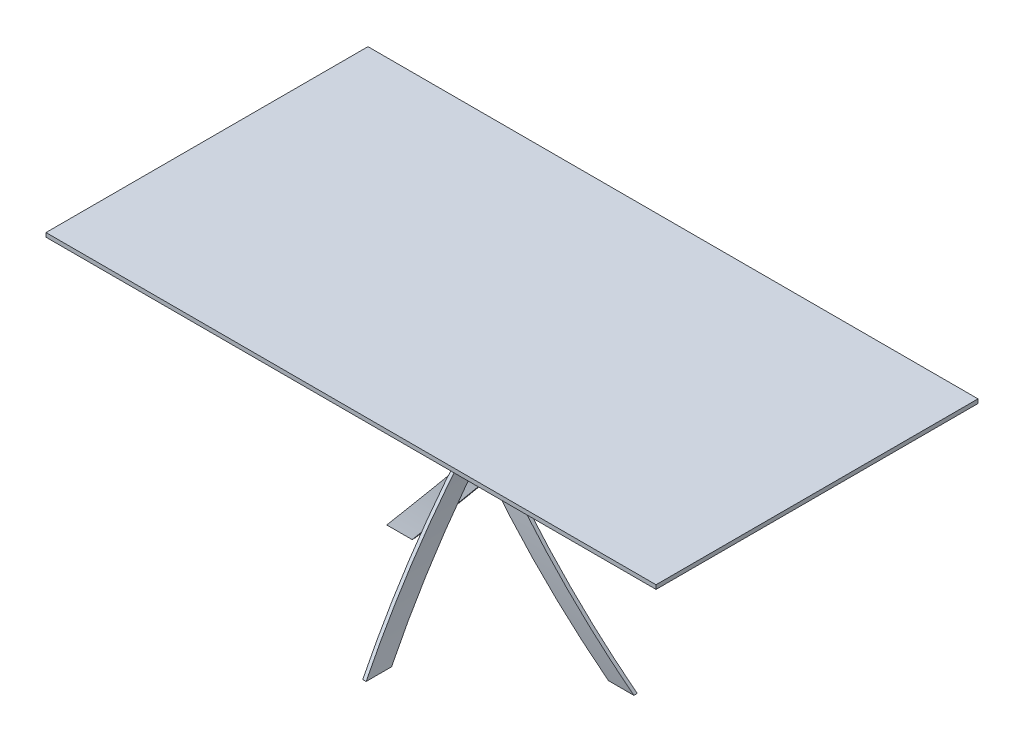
ISO-10303-21;
HEADER;
FILE_DESCRIPTION(('STEP AP214'),'2;1');
FILE_NAME('part.step','',(''),(''),'','','');
FILE_SCHEMA(('AUTOMOTIVE_DESIGN { 1 0 10303 214 1 1 1 1 }'));
ENDSEC;
DATA;
#1=APPLICATION_CONTEXT('core data for automotive mechanical design processes');
#2=APPLICATION_PROTOCOL_DEFINITION('international standard','automotive_design',2000,#1);
#3=PRODUCT_CONTEXT('',#1,'mechanical');
#4=PRODUCT('Part','Part','',(#3));
#5=PRODUCT_RELATED_PRODUCT_CATEGORY('part','',(#4));
#6=PRODUCT_DEFINITION_FORMATION('','',#4);
#7=PRODUCT_DEFINITION_CONTEXT('part definition',#1,'design');
#8=PRODUCT_DEFINITION('design','',#6,#7);
#9=PRODUCT_DEFINITION_SHAPE('','',#8);
#10=(LENGTH_UNIT() NAMED_UNIT(*) SI_UNIT(.MILLI.,.METRE.));
#11=(NAMED_UNIT(*) PLANE_ANGLE_UNIT() SI_UNIT($,.RADIAN.));
#12=(NAMED_UNIT(*) SI_UNIT($,.STERADIAN.) SOLID_ANGLE_UNIT());
#13=UNCERTAINTY_MEASURE_WITH_UNIT(LENGTH_MEASURE(1.E-05),#10,'distance_accuracy_value','');
#14=(GEOMETRIC_REPRESENTATION_CONTEXT(3) GLOBAL_UNCERTAINTY_ASSIGNED_CONTEXT((#13)) GLOBAL_UNIT_ASSIGNED_CONTEXT((#10,
#11,#12)) REPRESENTATION_CONTEXT('',''));
#15=CARTESIAN_POINT('',(0.,0.,0.));
#16=DIRECTION('',(0.,0.,1.));
#17=DIRECTION('',(1.,0.,0.));
#18=AXIS2_PLACEMENT_3D('',#15,#16,#17);
#19=CARTESIAN_POINT('',(1721.56180703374,370.,500.000000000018));
#20=DIRECTION('',(0.,0.,-1.));
#21=DIRECTION('',(-1.,0.,0.));
#22=AXIS2_PLACEMENT_3D('',#19,#20,#21);
#23=CYLINDRICAL_SURFACE('',#22,1800.);
#24=DIRECTION('',(0.,0.,-1.));
#25=VECTOR('',#24,1.);
#26=CARTESIAN_POINT('',(-40.4188966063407,1.99999999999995,499.999999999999));
#27=LINE('',#26,#25);
#28=CARTESIAN_POINT('',(-40.4188966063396,1.99999999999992,399.994999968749));
#29=VERTEX_POINT('',#28);
#30=CARTESIAN_POINT('',(-40.418896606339,1.99999999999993,324.994999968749));
#31=VERTEX_POINT('',#30);
#32=EDGE_CURVE('E70',#29,#31,#27,.T.);
#33=ORIENTED_EDGE('',*,*,#32,.F.);
#34=CARTESIAN_POINT('',(1721.56180703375,370.,100.808008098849));
#35=DIRECTION('',(0.,0.63083008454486,0.775921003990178));
#36=DIRECTION('',(0.,0.775921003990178,-0.63083008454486));
#37=AXIS2_PLACEMENT_3D('',#34,#35,#36);
#38=ELLIPSE('',#37,2319.82378456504,1800.);
#39=CARTESIAN_POINT('',(-39.9999999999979,740.,-200.005000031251));
#40=VERTEX_POINT('',#39);
#41=EDGE_CURVE('E90',#40,#29,#38,.T.);
#42=ORIENTED_EDGE('',*,*,#41,.F.);
#43=CARTESIAN_POINT('',(1721.56180703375,370.,-200.005000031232));
#44=DIRECTION('',(0.,0.,-1.));
#45=DIRECTION('',(-1.,0.,0.));
#46=AXIS2_PLACEMENT_3D('',#43,#44,#45);
#47=CIRCLE('',#46,1800.);
#48=CARTESIAN_POINT('',(-56.8799090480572,647.75,-200.005000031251));
#49=VERTEX_POINT('',#48);
#50=EDGE_CURVE('E87',#49,#40,#47,.T.);
#51=ORIENTED_EDGE('',*,*,#50,.F.);
#52=CARTESIAN_POINT('',(1721.56180703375,370.,25.808008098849));
#53=DIRECTION('',(0.,-0.63083008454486,-0.775921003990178));
#54=DIRECTION('',(0.,0.775921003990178,-0.63083008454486));
#55=AXIS2_PLACEMENT_3D('',#52,#53,#54);
#56=ELLIPSE('',#55,2319.82378456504,1800.);
#57=EDGE_CURVE('E50',#31,#49,#56,.T.);
#58=ORIENTED_EDGE('',*,*,#57,.F.);
#59=EDGE_LOOP('',(#33,#42,#51,#58));
#60=FACE_BOUND('',#59,.T.);
#61=ADVANCED_FACE('F46',(#60),#23,.T.);
#62=CARTESIAN_POINT('',(-300.000000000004,1.99999999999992,399.994999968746));
#63=DIRECTION('',(0.,0.63083008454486,0.775921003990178));
#64=DIRECTION('',(0.,-0.775921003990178,0.63083008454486));
#65=AXIS2_PLACEMENT_3D('',#62,#63,#64);
#66=PLANE('',#65);
#67=DIRECTION('',(1.,0.,0.));
#68=VECTOR('',#67,1.);
#69=CARTESIAN_POINT('',(-299.999999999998,740.,-200.005000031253));
#70=LINE('',#69,#68);
#71=CARTESIAN_POINT('',(-29.9999999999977,740.,-200.005000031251));
#72=VERTEX_POINT('',#71);
#73=EDGE_CURVE('E110',#40,#72,#70,.T.);
#74=ORIENTED_EDGE('',*,*,#73,.F.);
#75=ORIENTED_EDGE('',*,*,#41,.T.);
#76=DIRECTION('',(1.,0.,0.));
#77=VECTOR('',#76,1.);
#78=CARTESIAN_POINT('',(-300.000000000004,1.99999999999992,399.994999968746));
#79=LINE('',#78,#77);
#80=CARTESIAN_POINT('',(-30.4188966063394,1.99999999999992,399.994999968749));
#81=VERTEX_POINT('',#80);
#82=EDGE_CURVE('E104',#29,#81,#79,.T.);
#83=ORIENTED_EDGE('',*,*,#82,.T.);
#84=CARTESIAN_POINT('',(1731.56180703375,370.,100.808008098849));
#85=DIRECTION('',(0.,0.63083008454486,0.775921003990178));
#86=DIRECTION('',(0.,0.775921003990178,-0.63083008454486));
#87=AXIS2_PLACEMENT_3D('',#84,#85,#86);
#88=ELLIPSE('',#87,2319.82378456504,1800.);
#89=EDGE_CURVE('E95',#81,#72,#88,.F.);
#90=ORIENTED_EDGE('',*,*,#89,.T.);
#91=EDGE_LOOP('',(#74,#75,#83,#90));
#92=FACE_BOUND('',#91,.T.);
#93=ADVANCED_FACE('F119',(#92),#66,.T.);
#94=CARTESIAN_POINT('',(-299.999999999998,647.75,-200.005000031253));
#95=DIRECTION('',(0.,-0.63083008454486,-0.775921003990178));
#96=DIRECTION('',(0.,0.775921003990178,-0.63083008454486));
#97=AXIS2_PLACEMENT_3D('',#94,#95,#96);
#98=PLANE('',#97);
#99=DIRECTION('',(1.,0.,0.));
#100=VECTOR('',#99,1.);
#101=CARTESIAN_POINT('',(-300.000000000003,1.99999999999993,324.994999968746));
#102=LINE('',#101,#100);
#103=CARTESIAN_POINT('',(-30.4188966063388,1.99999999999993,324.994999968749));
#104=VERTEX_POINT('',#103);
#105=EDGE_CURVE('E12',#31,#104,#102,.T.);
#106=ORIENTED_EDGE('',*,*,#105,.F.);
#107=ORIENTED_EDGE('',*,*,#57,.T.);
#108=DIRECTION('',(1.,0.,0.));
#109=VECTOR('',#108,1.);
#110=CARTESIAN_POINT('',(-299.999999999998,647.75,-200.005000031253));
#111=LINE('',#110,#109);
#112=CARTESIAN_POINT('',(-46.879909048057,647.75,-200.005000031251));
#113=VERTEX_POINT('',#112);
#114=EDGE_CURVE('E55',#49,#113,#111,.T.);
#115=ORIENTED_EDGE('',*,*,#114,.T.);
#116=CARTESIAN_POINT('',(1731.56180703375,370.,25.8080080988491));
#117=DIRECTION('',(0.,-0.63083008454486,-0.775921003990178));
#118=DIRECTION('',(0.,0.775921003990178,-0.63083008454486));
#119=AXIS2_PLACEMENT_3D('',#116,#117,#118);
#120=ELLIPSE('',#119,2319.82378456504,1800.);
#121=EDGE_CURVE('E100',#113,#104,#120,.F.);
#122=ORIENTED_EDGE('',*,*,#121,.T.);
#123=EDGE_LOOP('',(#106,#107,#115,#122));
#124=FACE_BOUND('',#123,.T.);
#125=ADVANCED_FACE('F48',(#124),#98,.T.);
#126=CARTESIAN_POINT('',(-300.000000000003,1.99999999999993,324.994999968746));
#127=DIRECTION('',(0.,-1.,0.));
#128=DIRECTION('',(0.,0.,-1.));
#129=AXIS2_PLACEMENT_3D('',#126,#127,#128);
#130=PLANE('',#129);
#131=ORIENTED_EDGE('',*,*,#82,.F.);
#132=ORIENTED_EDGE('',*,*,#32,.T.);
#133=ORIENTED_EDGE('',*,*,#105,.T.);
#134=DIRECTION('',(0.,0.,-1.));
#135=VECTOR('',#134,1.);
#136=CARTESIAN_POINT('',(-30.4188966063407,1.99999999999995,500.));
#137=LINE('',#136,#135);
#138=EDGE_CURVE('E62',#104,#81,#137,.F.);
#139=ORIENTED_EDGE('',*,*,#138,.T.);
#140=EDGE_LOOP('',(#131,#132,#133,#139));
#141=FACE_BOUND('',#140,.T.);
#142=ADVANCED_FACE('F118',(#141),#130,.T.);
#143=CARTESIAN_POINT('',(-299.999999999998,740.,-200.005000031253));
#144=DIRECTION('',(0.,0.,-1.));
#145=DIRECTION('',(-1.,0.,0.));
#146=AXIS2_PLACEMENT_3D('',#143,#144,#145);
#147=PLANE('',#146);
#148=ORIENTED_EDGE('',*,*,#114,.F.);
#149=ORIENTED_EDGE('',*,*,#50,.T.);
#150=ORIENTED_EDGE('',*,*,#73,.T.);
#151=CARTESIAN_POINT('',(1731.56180703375,370.,-200.005000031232));
#152=DIRECTION('',(0.,0.,-1.));
#153=DIRECTION('',(-1.,0.,0.));
#154=AXIS2_PLACEMENT_3D('',#151,#152,#153);
#155=CIRCLE('',#154,1800.);
#156=EDGE_CURVE('E96',#72,#113,#155,.F.);
#157=ORIENTED_EDGE('',*,*,#156,.T.);
#158=EDGE_LOOP('',(#148,#149,#150,#157));
#159=FACE_BOUND('',#158,.T.);
#160=ADVANCED_FACE('F101',(#159),#147,.T.);
#161=CARTESIAN_POINT('',(1731.56180703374,370.,500.000000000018));
#162=DIRECTION('',(0.,0.,-1.));
#163=DIRECTION('',(-1.,0.,0.));
#164=AXIS2_PLACEMENT_3D('',#161,#162,#163);
#165=CYLINDRICAL_SURFACE('',#164,1800.);
#166=ORIENTED_EDGE('',*,*,#138,.F.);
#167=ORIENTED_EDGE('',*,*,#121,.F.);
#168=ORIENTED_EDGE('',*,*,#156,.F.);
#169=ORIENTED_EDGE('',*,*,#89,.F.);
#170=EDGE_LOOP('',(#166,#167,#168,#169));
#171=FACE_BOUND('',#170,.T.);
#172=ADVANCED_FACE('F122',(#171),#165,.F.);
#173=CLOSED_SHELL('',(#61,#93,#125,#142,#160,#172));
#174=MANIFOLD_SOLID_BREP('B2',#173);
#175=CARTESIAN_POINT('',(500.,370.,-1721.56180703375));
#176=DIRECTION('',(-1.,0.,0.));
#177=DIRECTION('',(0.,0.,1.));
#178=AXIS2_PLACEMENT_3D('',#175,#176,#177);
#179=CYLINDRICAL_SURFACE('',#178,1800.);
#180=DIRECTION('',(-1.,0.,0.));
#181=VECTOR('',#180,1.);
#182=CARTESIAN_POINT('',(500.,1.99999999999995,40.4188966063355));
#183=LINE('',#182,#181);
#184=CARTESIAN_POINT('',(399.99499996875,1.99999999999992,40.4188966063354));
#185=VERTEX_POINT('',#184);
#186=CARTESIAN_POINT('',(324.99499996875,1.99999999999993,40.4188966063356));
#187=VERTEX_POINT('',#186);
#188=EDGE_CURVE('E216',#185,#187,#183,.T.);
#189=ORIENTED_EDGE('',*,*,#188,.F.);
#190=CARTESIAN_POINT('',(100.808008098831,370.,-1721.56180703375));
#191=DIRECTION('',(0.775921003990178,0.63083008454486,0.));
#192=DIRECTION('',(-0.63083008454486,0.775921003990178,0.));
#193=AXIS2_PLACEMENT_3D('',#190,#191,#192);
#194=ELLIPSE('',#193,2319.82378456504,1800.);
#195=CARTESIAN_POINT('',(-200.00500003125,740.,40.));
#196=VERTEX_POINT('',#195);
#197=EDGE_CURVE('E236',#196,#185,#194,.T.);
#198=ORIENTED_EDGE('',*,*,#197,.F.);
#199=CARTESIAN_POINT('',(-200.00500003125,370.,-1721.56180703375));
#200=DIRECTION('',(-1.,0.,0.));
#201=DIRECTION('',(0.,0.,1.));
#202=AXIS2_PLACEMENT_3D('',#199,#200,#201);
#203=CIRCLE('',#202,1800.);
#204=CARTESIAN_POINT('',(-200.00500003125,647.75,56.8799090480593));
#205=VERTEX_POINT('',#204);
#206=EDGE_CURVE('E233',#205,#196,#203,.T.);
#207=ORIENTED_EDGE('',*,*,#206,.F.);
#208=CARTESIAN_POINT('',(25.808008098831,370.,-1721.56180703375));
#209=DIRECTION('',(-0.775921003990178,-0.63083008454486,0.));
#210=DIRECTION('',(-0.63083008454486,0.775921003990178,0.));
#211=AXIS2_PLACEMENT_3D('',#208,#209,#210);
#212=ELLIPSE('',#211,2319.82378456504,1800.);
#213=EDGE_CURVE('E196',#187,#205,#212,.T.);
#214=ORIENTED_EDGE('',*,*,#213,.F.);
#215=EDGE_LOOP('',(#189,#198,#207,#214));
#216=FACE_BOUND('',#215,.T.);
#217=ADVANCED_FACE('F192',(#216),#179,.T.);
#218=CARTESIAN_POINT('',(399.99499996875,1.99999999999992,300.));
#219=DIRECTION('',(0.775921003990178,0.63083008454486,0.));
#220=DIRECTION('',(0.63083008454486,-0.775921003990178,0.));
#221=AXIS2_PLACEMENT_3D('',#218,#219,#220);
#222=PLANE('',#221);
#223=DIRECTION('',(0.,0.,-1.));
#224=VECTOR('',#223,1.);
#225=CARTESIAN_POINT('',(-200.00500003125,740.,300.));
#226=LINE('',#225,#224);
#227=CARTESIAN_POINT('',(-200.00500003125,740.,29.9999999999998));
#228=VERTEX_POINT('',#227);
#229=EDGE_CURVE('E256',#196,#228,#226,.T.);
#230=ORIENTED_EDGE('',*,*,#229,.F.);
#231=ORIENTED_EDGE('',*,*,#197,.T.);
#232=DIRECTION('',(0.,0.,-1.));
#233=VECTOR('',#232,1.);
#234=CARTESIAN_POINT('',(399.99499996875,1.99999999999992,300.));
#235=LINE('',#234,#233);
#236=CARTESIAN_POINT('',(399.99499996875,1.99999999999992,30.4188966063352));
#237=VERTEX_POINT('',#236);
#238=EDGE_CURVE('E250',#185,#237,#235,.T.);
#239=ORIENTED_EDGE('',*,*,#238,.T.);
#240=CARTESIAN_POINT('',(100.808008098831,370.,-1731.56180703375));
#241=DIRECTION('',(0.775921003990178,0.63083008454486,0.));
#242=DIRECTION('',(-0.63083008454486,0.775921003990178,0.));
#243=AXIS2_PLACEMENT_3D('',#240,#241,#242);
#244=ELLIPSE('',#243,2319.82378456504,1800.);
#245=EDGE_CURVE('E241',#237,#228,#244,.F.);
#246=ORIENTED_EDGE('',*,*,#245,.T.);
#247=EDGE_LOOP('',(#230,#231,#239,#246));
#248=FACE_BOUND('',#247,.T.);
#249=ADVANCED_FACE('F265',(#248),#222,.T.);
#250=CARTESIAN_POINT('',(-200.00500003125,647.75,300.));
#251=DIRECTION('',(-0.775921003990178,-0.63083008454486,0.));
#252=DIRECTION('',(-0.63083008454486,0.775921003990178,0.));
#253=AXIS2_PLACEMENT_3D('',#250,#251,#252);
#254=PLANE('',#253);
#255=DIRECTION('',(0.,0.,-1.));
#256=VECTOR('',#255,1.);
#257=CARTESIAN_POINT('',(324.99499996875,1.99999999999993,300.));
#258=LINE('',#257,#256);
#259=CARTESIAN_POINT('',(324.99499996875,1.99999999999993,30.4188966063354));
#260=VERTEX_POINT('',#259);
#261=EDGE_CURVE('E44',#187,#260,#258,.T.);
#262=ORIENTED_EDGE('',*,*,#261,.F.);
#263=ORIENTED_EDGE('',*,*,#213,.T.);
#264=DIRECTION('',(0.,0.,-1.));
#265=VECTOR('',#264,1.);
#266=CARTESIAN_POINT('',(-200.00500003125,647.75,300.));
#267=LINE('',#266,#265);
#268=CARTESIAN_POINT('',(-200.00500003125,647.75,46.8799090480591));
#269=VERTEX_POINT('',#268);
#270=EDGE_CURVE('E201',#205,#269,#267,.T.);
#271=ORIENTED_EDGE('',*,*,#270,.T.);
#272=CARTESIAN_POINT('',(25.808008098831,370.,-1731.56180703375));
#273=DIRECTION('',(-0.775921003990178,-0.63083008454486,0.));
#274=DIRECTION('',(-0.63083008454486,0.775921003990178,0.));
#275=AXIS2_PLACEMENT_3D('',#272,#273,#274);
#276=ELLIPSE('',#275,2319.82378456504,1800.);
#277=EDGE_CURVE('E246',#269,#260,#276,.F.);
#278=ORIENTED_EDGE('',*,*,#277,.T.);
#279=EDGE_LOOP('',(#262,#263,#271,#278));
#280=FACE_BOUND('',#279,.T.);
#281=ADVANCED_FACE('F194',(#280),#254,.T.);
#282=CARTESIAN_POINT('',(324.99499996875,1.99999999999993,300.));
#283=DIRECTION('',(0.,-1.,0.));
#284=DIRECTION('',(-1.,0.,0.));
#285=AXIS2_PLACEMENT_3D('',#282,#283,#284);
#286=PLANE('',#285);
#287=ORIENTED_EDGE('',*,*,#238,.F.);
#288=ORIENTED_EDGE('',*,*,#188,.T.);
#289=ORIENTED_EDGE('',*,*,#261,.T.);
#290=DIRECTION('',(-1.,0.,0.));
#291=VECTOR('',#290,1.);
#292=CARTESIAN_POINT('',(500.,1.99999999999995,30.4188966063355));
#293=LINE('',#292,#291);
#294=EDGE_CURVE('E208',#260,#237,#293,.F.);
#295=ORIENTED_EDGE('',*,*,#294,.T.);
#296=EDGE_LOOP('',(#287,#288,#289,#295));
#297=FACE_BOUND('',#296,.T.);
#298=ADVANCED_FACE('F264',(#297),#286,.T.);
#299=CARTESIAN_POINT('',(-200.00500003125,740.,300.));
#300=DIRECTION('',(-1.,0.,0.));
#301=DIRECTION('',(0.,0.,1.));
#302=AXIS2_PLACEMENT_3D('',#299,#300,#301);
#303=PLANE('',#302);
#304=ORIENTED_EDGE('',*,*,#270,.F.);
#305=ORIENTED_EDGE('',*,*,#206,.T.);
#306=ORIENTED_EDGE('',*,*,#229,.T.);
#307=CARTESIAN_POINT('',(-200.00500003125,370.,-1731.56180703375));
#308=DIRECTION('',(-1.,0.,0.));
#309=DIRECTION('',(0.,0.,1.));
#310=AXIS2_PLACEMENT_3D('',#307,#308,#309);
#311=CIRCLE('',#310,1800.);
#312=EDGE_CURVE('E242',#228,#269,#311,.F.);
#313=ORIENTED_EDGE('',*,*,#312,.T.);
#314=EDGE_LOOP('',(#304,#305,#306,#313));
#315=FACE_BOUND('',#314,.T.);
#316=ADVANCED_FACE('F247',(#315),#303,.T.);
#317=CARTESIAN_POINT('',(500.,370.,-1731.56180703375));
#318=DIRECTION('',(-1.,0.,0.));
#319=DIRECTION('',(0.,0.,1.));
#320=AXIS2_PLACEMENT_3D('',#317,#318,#319);
#321=CYLINDRICAL_SURFACE('',#320,1800.);
#322=ORIENTED_EDGE('',*,*,#294,.F.);
#323=ORIENTED_EDGE('',*,*,#277,.F.);
#324=ORIENTED_EDGE('',*,*,#312,.F.);
#325=ORIENTED_EDGE('',*,*,#245,.F.);
#326=EDGE_LOOP('',(#322,#323,#324,#325));
#327=FACE_BOUND('',#326,.T.);
#328=ADVANCED_FACE('F268',(#327),#321,.F.);
#329=CLOSED_SHELL('',(#217,#249,#281,#298,#316,#328));
#330=MANIFOLD_SOLID_BREP('B6',#329);
#331=CARTESIAN_POINT('',(-1721.56180703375,370.,-500.000000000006));
#332=DIRECTION('',(0.,0.,1.));
#333=DIRECTION('',(1.,0.,0.));
#334=AXIS2_PLACEMENT_3D('',#331,#332,#333);
#335=CYLINDRICAL_SURFACE('',#334,1800.);
#336=DIRECTION('',(0.,0.,1.));
#337=VECTOR('',#336,1.);
#338=CARTESIAN_POINT('',(40.4188966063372,1.99999999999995,-500.));
#339=LINE('',#338,#337);
#340=CARTESIAN_POINT('',(40.4188966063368,1.99999999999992,-399.994999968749));
#341=VERTEX_POINT('',#340);
#342=CARTESIAN_POINT('',(40.4188966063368,1.99999999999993,-324.994999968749));
#343=VERTEX_POINT('',#342);
#344=EDGE_CURVE('E362',#341,#343,#339,.T.);
#345=ORIENTED_EDGE('',*,*,#344,.F.);
#346=CARTESIAN_POINT('',(-1721.56180703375,370.,-100.808008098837));
#347=DIRECTION('',(0.,0.63083008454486,-0.775921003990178));
#348=DIRECTION('',(0.,0.775921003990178,0.63083008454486));
#349=AXIS2_PLACEMENT_3D('',#346,#347,#348);
#350=ELLIPSE('',#349,2319.82378456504,1800.);
#351=CARTESIAN_POINT('',(39.9999999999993,740.,200.00500003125));
#352=VERTEX_POINT('',#351);
#353=EDGE_CURVE('E382',#352,#341,#350,.T.);
#354=ORIENTED_EDGE('',*,*,#353,.F.);
#355=CARTESIAN_POINT('',(-1721.56180703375,370.,200.005000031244));
#356=DIRECTION('',(0.,0.,1.));
#357=DIRECTION('',(1.,0.,0.));
#358=AXIS2_PLACEMENT_3D('',#355,#356,#357);
#359=CIRCLE('',#358,1800.);
#360=CARTESIAN_POINT('',(56.8799090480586,647.75,200.00500003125));
#361=VERTEX_POINT('',#360);
#362=EDGE_CURVE('E379',#361,#352,#359,.T.);
#363=ORIENTED_EDGE('',*,*,#362,.F.);
#364=CARTESIAN_POINT('',(-1721.56180703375,370.,-25.808008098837));
#365=DIRECTION('',(0.,-0.63083008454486,0.775921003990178));
#366=DIRECTION('',(0.,0.775921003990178,0.63083008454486));
#367=AXIS2_PLACEMENT_3D('',#364,#365,#366);
#368=ELLIPSE('',#367,2319.82378456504,1800.);
#369=EDGE_CURVE('E342',#343,#361,#368,.T.);
#370=ORIENTED_EDGE('',*,*,#369,.F.);
#371=EDGE_LOOP('',(#345,#354,#363,#370));
#372=FACE_BOUND('',#371,.T.);
#373=ADVANCED_FACE('F338',(#372),#335,.T.);
#374=CARTESIAN_POINT('',(300.000000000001,1.99999999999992,-399.994999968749));
#375=DIRECTION('',(0.,0.63083008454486,-0.775921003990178));
#376=DIRECTION('',(0.,-0.775921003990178,-0.63083008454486));
#377=AXIS2_PLACEMENT_3D('',#374,#375,#376);
#378=PLANE('',#377);
#379=DIRECTION('',(-1.,0.,0.));
#380=VECTOR('',#379,1.);
#381=CARTESIAN_POINT('',(299.999999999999,740.,200.005000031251));
#382=LINE('',#381,#380);
#383=CARTESIAN_POINT('',(29.9999999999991,740.,200.00500003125));
#384=VERTEX_POINT('',#383);
#385=EDGE_CURVE('E402',#352,#384,#382,.T.);
#386=ORIENTED_EDGE('',*,*,#385,.F.);
#387=ORIENTED_EDGE('',*,*,#353,.T.);
#388=DIRECTION('',(-1.,0.,0.));
#389=VECTOR('',#388,1.);
#390=CARTESIAN_POINT('',(300.000000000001,1.99999999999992,-399.994999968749));
#391=LINE('',#390,#389);
#392=CARTESIAN_POINT('',(30.4188966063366,1.99999999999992,-399.99499996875));
#393=VERTEX_POINT('',#392);
#394=EDGE_CURVE('E396',#341,#393,#391,.T.);
#395=ORIENTED_EDGE('',*,*,#394,.T.);
#396=CARTESIAN_POINT('',(-1731.56180703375,370.,-100.808008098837));
#397=DIRECTION('',(0.,0.63083008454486,-0.775921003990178));
#398=DIRECTION('',(0.,0.775921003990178,0.63083008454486));
#399=AXIS2_PLACEMENT_3D('',#396,#397,#398);
#400=ELLIPSE('',#399,2319.82378456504,1800.);
#401=EDGE_CURVE('E387',#393,#384,#400,.F.);
#402=ORIENTED_EDGE('',*,*,#401,.T.);
#403=EDGE_LOOP('',(#386,#387,#395,#402));
#404=FACE_BOUND('',#403,.T.);
#405=ADVANCED_FACE('F411',(#404),#378,.T.);
#406=CARTESIAN_POINT('',(299.999999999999,647.75,200.005000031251));
#407=DIRECTION('',(0.,-0.63083008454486,0.775921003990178));
#408=DIRECTION('',(0.,0.775921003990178,0.63083008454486));
#409=AXIS2_PLACEMENT_3D('',#406,#407,#408);
#410=PLANE('',#409);
#411=DIRECTION('',(-1.,0.,0.));
#412=VECTOR('',#411,1.);
#413=CARTESIAN_POINT('',(300.000000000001,1.99999999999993,-324.994999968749));
#414=LINE('',#413,#412);
#415=CARTESIAN_POINT('',(30.4188966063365,1.99999999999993,-324.99499996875));
#416=VERTEX_POINT('',#415);
#417=EDGE_CURVE('E190',#343,#416,#414,.T.);
#418=ORIENTED_EDGE('',*,*,#417,.F.);
#419=ORIENTED_EDGE('',*,*,#369,.T.);
#420=DIRECTION('',(-1.,0.,0.));
#421=VECTOR('',#420,1.);
#422=CARTESIAN_POINT('',(299.999999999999,647.75,200.005000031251));
#423=LINE('',#422,#421);
#424=CARTESIAN_POINT('',(46.8799090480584,647.75,200.00500003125));
#425=VERTEX_POINT('',#424);
#426=EDGE_CURVE('E347',#361,#425,#423,.T.);
#427=ORIENTED_EDGE('',*,*,#426,.T.);
#428=CARTESIAN_POINT('',(-1731.56180703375,370.,-25.808008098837));
#429=DIRECTION('',(0.,-0.63083008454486,0.775921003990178));
#430=DIRECTION('',(0.,0.775921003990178,0.63083008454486));
#431=AXIS2_PLACEMENT_3D('',#428,#429,#430);
#432=ELLIPSE('',#431,2319.82378456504,1800.);
#433=EDGE_CURVE('E392',#425,#416,#432,.F.);
#434=ORIENTED_EDGE('',*,*,#433,.T.);
#435=EDGE_LOOP('',(#418,#419,#427,#434));
#436=FACE_BOUND('',#435,.T.);
#437=ADVANCED_FACE('F340',(#436),#410,.T.);
#438=CARTESIAN_POINT('',(300.000000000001,1.99999999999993,-324.994999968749));
#439=DIRECTION('',(0.,-1.,0.));
#440=DIRECTION('',(0.,0.,1.));
#441=AXIS2_PLACEMENT_3D('',#438,#439,#440);
#442=PLANE('',#441);
#443=ORIENTED_EDGE('',*,*,#394,.F.);
#444=ORIENTED_EDGE('',*,*,#344,.T.);
#445=ORIENTED_EDGE('',*,*,#417,.T.);
#446=DIRECTION('',(0.,0.,1.));
#447=VECTOR('',#446,1.);
#448=CARTESIAN_POINT('',(30.4188966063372,1.99999999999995,-500.));
#449=LINE('',#448,#447);
#450=EDGE_CURVE('E354',#416,#393,#449,.F.);
#451=ORIENTED_EDGE('',*,*,#450,.T.);
#452=EDGE_LOOP('',(#443,#444,#445,#451));
#453=FACE_BOUND('',#452,.T.);
#454=ADVANCED_FACE('F410',(#453),#442,.T.);
#455=CARTESIAN_POINT('',(299.999999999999,740.,200.005000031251));
#456=DIRECTION('',(0.,0.,1.));
#457=DIRECTION('',(1.,0.,0.));
#458=AXIS2_PLACEMENT_3D('',#455,#456,#457);
#459=PLANE('',#458);
#460=ORIENTED_EDGE('',*,*,#426,.F.);
#461=ORIENTED_EDGE('',*,*,#362,.T.);
#462=ORIENTED_EDGE('',*,*,#385,.T.);
#463=CARTESIAN_POINT('',(-1731.56180703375,370.,200.005000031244));
#464=DIRECTION('',(0.,0.,1.));
#465=DIRECTION('',(1.,0.,0.));
#466=AXIS2_PLACEMENT_3D('',#463,#464,#465);
#467=CIRCLE('',#466,1800.);
#468=EDGE_CURVE('E388',#384,#425,#467,.F.);
#469=ORIENTED_EDGE('',*,*,#468,.T.);
#470=EDGE_LOOP('',(#460,#461,#462,#469));
#471=FACE_BOUND('',#470,.T.);
#472=ADVANCED_FACE('F393',(#471),#459,.T.);
#473=CARTESIAN_POINT('',(-1731.56180703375,370.,-500.000000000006));
#474=DIRECTION('',(0.,0.,1.));
#475=DIRECTION('',(1.,0.,0.));
#476=AXIS2_PLACEMENT_3D('',#473,#474,#475);
#477=CYLINDRICAL_SURFACE('',#476,1800.);
#478=ORIENTED_EDGE('',*,*,#450,.F.);
#479=ORIENTED_EDGE('',*,*,#433,.F.);
#480=ORIENTED_EDGE('',*,*,#468,.F.);
#481=ORIENTED_EDGE('',*,*,#401,.F.);
#482=EDGE_LOOP('',(#478,#479,#480,#481));
#483=FACE_BOUND('',#482,.T.);
#484=ADVANCED_FACE('F414',(#483),#477,.F.);
#485=CLOSED_SHELL('',(#373,#405,#437,#454,#472,#484));
#486=MANIFOLD_SOLID_BREP('B38',#485);
#487=CARTESIAN_POINT('',(-500.,370.,1721.56180703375));
#488=DIRECTION('',(1.,0.,0.));
#489=DIRECTION('',(0.,0.,-1.));
#490=AXIS2_PLACEMENT_3D('',#487,#488,#489);
#491=CYLINDRICAL_SURFACE('',#490,1800.);
#492=DIRECTION('',(1.,0.,0.));
#493=VECTOR('',#492,1.);
#494=CARTESIAN_POINT('',(-500.,1.99999999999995,-40.4188966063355));
#495=LINE('',#494,#493);
#496=CARTESIAN_POINT('',(-399.99499996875,1.99999999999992,-40.4188966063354));
#497=VERTEX_POINT('',#496);
#498=CARTESIAN_POINT('',(-324.99499996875,1.99999999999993,-40.4188966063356));
#499=VERTEX_POINT('',#498);
#500=EDGE_CURVE('E507',#497,#499,#495,.T.);
#501=ORIENTED_EDGE('',*,*,#500,.F.);
#502=CARTESIAN_POINT('',(-100.808008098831,370.,1721.56180703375));
#503=DIRECTION('',(-0.775921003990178,0.63083008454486,0.));
#504=DIRECTION('',(0.63083008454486,0.775921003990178,0.));
#505=AXIS2_PLACEMENT_3D('',#502,#503,#504);
#506=ELLIPSE('',#505,2319.82378456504,1800.);
#507=CARTESIAN_POINT('',(200.00500003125,740.,-40.));
#508=VERTEX_POINT('',#507);
#509=EDGE_CURVE('E527',#508,#497,#506,.T.);
#510=ORIENTED_EDGE('',*,*,#509,.F.);
#511=CARTESIAN_POINT('',(200.00500003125,370.,1721.56180703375));
#512=DIRECTION('',(1.,0.,0.));
#513=DIRECTION('',(0.,0.,-1.));
#514=AXIS2_PLACEMENT_3D('',#511,#512,#513);
#515=CIRCLE('',#514,1800.);
#516=CARTESIAN_POINT('',(200.00500003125,647.75,-56.8799090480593));
#517=VERTEX_POINT('',#516);
#518=EDGE_CURVE('E524',#517,#508,#515,.T.);
#519=ORIENTED_EDGE('',*,*,#518,.F.);
#520=CARTESIAN_POINT('',(-25.808008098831,370.,1721.56180703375));
#521=DIRECTION('',(0.775921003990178,-0.63083008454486,0.));
#522=DIRECTION('',(0.63083008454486,0.775921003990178,0.));
#523=AXIS2_PLACEMENT_3D('',#520,#521,#522);
#524=ELLIPSE('',#523,2319.82378456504,1800.);
#525=EDGE_CURVE('E487',#499,#517,#524,.T.);
#526=ORIENTED_EDGE('',*,*,#525,.F.);
#527=EDGE_LOOP('',(#501,#510,#519,#526));
#528=FACE_BOUND('',#527,.T.);
#529=ADVANCED_FACE('F483',(#528),#491,.T.);
#530=CARTESIAN_POINT('',(-399.99499996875,1.99999999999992,-300.));
#531=DIRECTION('',(-0.775921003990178,0.63083008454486,0.));
#532=DIRECTION('',(-0.63083008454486,-0.775921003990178,0.));
#533=AXIS2_PLACEMENT_3D('',#530,#531,#532);
#534=PLANE('',#533);
#535=DIRECTION('',(0.,0.,1.));
#536=VECTOR('',#535,1.);
#537=CARTESIAN_POINT('',(200.00500003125,740.,-300.));
#538=LINE('',#537,#536);
#539=CARTESIAN_POINT('',(200.00500003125,740.,-29.9999999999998));
#540=VERTEX_POINT('',#539);
#541=EDGE_CURVE('E547',#508,#540,#538,.T.);
#542=ORIENTED_EDGE('',*,*,#541,.F.);
#543=ORIENTED_EDGE('',*,*,#509,.T.);
#544=DIRECTION('',(0.,0.,1.));
#545=VECTOR('',#544,1.);
#546=CARTESIAN_POINT('',(-399.99499996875,1.99999999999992,-300.));
#547=LINE('',#546,#545);
#548=CARTESIAN_POINT('',(-399.99499996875,1.99999999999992,-30.4188966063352));
#549=VERTEX_POINT('',#548);
#550=EDGE_CURVE('E541',#497,#549,#547,.T.);
#551=ORIENTED_EDGE('',*,*,#550,.T.);
#552=CARTESIAN_POINT('',(-100.808008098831,370.,1731.56180703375));
#553=DIRECTION('',(-0.775921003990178,0.63083008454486,0.));
#554=DIRECTION('',(0.63083008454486,0.775921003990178,0.));
#555=AXIS2_PLACEMENT_3D('',#552,#553,#554);
#556=ELLIPSE('',#555,2319.82378456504,1800.);
#557=EDGE_CURVE('E532',#549,#540,#556,.F.);
#558=ORIENTED_EDGE('',*,*,#557,.T.);
#559=EDGE_LOOP('',(#542,#543,#551,#558));
#560=FACE_BOUND('',#559,.T.);
#561=ADVANCED_FACE('F556',(#560),#534,.T.);
#562=CARTESIAN_POINT('',(200.00500003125,647.75,-300.));
#563=DIRECTION('',(0.775921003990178,-0.63083008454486,0.));
#564=DIRECTION('',(0.63083008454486,0.775921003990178,0.));
#565=AXIS2_PLACEMENT_3D('',#562,#563,#564);
#566=PLANE('',#565);
#567=DIRECTION('',(0.,0.,1.));
#568=VECTOR('',#567,1.);
#569=CARTESIAN_POINT('',(-324.99499996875,1.99999999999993,-300.));
#570=LINE('',#569,#568);
#571=CARTESIAN_POINT('',(-324.99499996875,1.99999999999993,-30.4188966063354));
#572=VERTEX_POINT('',#571);
#573=EDGE_CURVE('E336',#499,#572,#570,.T.);
#574=ORIENTED_EDGE('',*,*,#573,.F.);
#575=ORIENTED_EDGE('',*,*,#525,.T.);
#576=DIRECTION('',(0.,0.,1.));
#577=VECTOR('',#576,1.);
#578=CARTESIAN_POINT('',(200.00500003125,647.75,-300.));
#579=LINE('',#578,#577);
#580=CARTESIAN_POINT('',(200.00500003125,647.75,-46.8799090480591));
#581=VERTEX_POINT('',#580);
#582=EDGE_CURVE('E492',#517,#581,#579,.T.);
#583=ORIENTED_EDGE('',*,*,#582,.T.);
#584=CARTESIAN_POINT('',(-25.808008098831,370.,1731.56180703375));
#585=DIRECTION('',(0.775921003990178,-0.63083008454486,0.));
#586=DIRECTION('',(0.63083008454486,0.775921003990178,0.));
#587=AXIS2_PLACEMENT_3D('',#584,#585,#586);
#588=ELLIPSE('',#587,2319.82378456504,1800.);
#589=EDGE_CURVE('E537',#581,#572,#588,.F.);
#590=ORIENTED_EDGE('',*,*,#589,.T.);
#591=EDGE_LOOP('',(#574,#575,#583,#590));
#592=FACE_BOUND('',#591,.T.);
#593=ADVANCED_FACE('F485',(#592),#566,.T.);
#594=CARTESIAN_POINT('',(-324.99499996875,1.99999999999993,-300.));
#595=DIRECTION('',(0.,-1.,0.));
#596=DIRECTION('',(1.,0.,0.));
#597=AXIS2_PLACEMENT_3D('',#594,#595,#596);
#598=PLANE('',#597);
#599=ORIENTED_EDGE('',*,*,#550,.F.);
#600=ORIENTED_EDGE('',*,*,#500,.T.);
#601=ORIENTED_EDGE('',*,*,#573,.T.);
#602=DIRECTION('',(1.,0.,0.));
#603=VECTOR('',#602,1.);
#604=CARTESIAN_POINT('',(-500.,1.99999999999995,-30.4188966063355));
#605=LINE('',#604,#603);
#606=EDGE_CURVE('E499',#572,#549,#605,.F.);
#607=ORIENTED_EDGE('',*,*,#606,.T.);
#608=EDGE_LOOP('',(#599,#600,#601,#607));
#609=FACE_BOUND('',#608,.T.);
#610=ADVANCED_FACE('F555',(#609),#598,.T.);
#611=CARTESIAN_POINT('',(200.00500003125,740.,-300.));
#612=DIRECTION('',(1.,0.,0.));
#613=DIRECTION('',(0.,0.,-1.));
#614=AXIS2_PLACEMENT_3D('',#611,#612,#613);
#615=PLANE('',#614);
#616=ORIENTED_EDGE('',*,*,#582,.F.);
#617=ORIENTED_EDGE('',*,*,#518,.T.);
#618=ORIENTED_EDGE('',*,*,#541,.T.);
#619=CARTESIAN_POINT('',(200.00500003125,370.,1731.56180703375));
#620=DIRECTION('',(1.,0.,0.));
#621=DIRECTION('',(0.,0.,-1.));
#622=AXIS2_PLACEMENT_3D('',#619,#620,#621);
#623=CIRCLE('',#622,1800.);
#624=EDGE_CURVE('E533',#540,#581,#623,.F.);
#625=ORIENTED_EDGE('',*,*,#624,.T.);
#626=EDGE_LOOP('',(#616,#617,#618,#625));
#627=FACE_BOUND('',#626,.T.);
#628=ADVANCED_FACE('F538',(#627),#615,.T.);
#629=CARTESIAN_POINT('',(-500.,370.,1731.56180703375));
#630=DIRECTION('',(1.,0.,0.));
#631=DIRECTION('',(0.,0.,-1.));
#632=AXIS2_PLACEMENT_3D('',#629,#630,#631);
#633=CYLINDRICAL_SURFACE('',#632,1800.);
#634=ORIENTED_EDGE('',*,*,#606,.F.);
#635=ORIENTED_EDGE('',*,*,#589,.F.);
#636=ORIENTED_EDGE('',*,*,#624,.F.);
#637=ORIENTED_EDGE('',*,*,#557,.F.);
#638=EDGE_LOOP('',(#634,#635,#636,#637));
#639=FACE_BOUND('',#638,.T.);
#640=ADVANCED_FACE('F559',(#639),#633,.F.);
#641=CLOSED_SHELL('',(#529,#561,#593,#610,#628,#640));
#642=MANIFOLD_SOLID_BREP('B184',#641);
#643=CARTESIAN_POINT('',(900.,752.,-475.));
#644=DIRECTION('',(-1.,0.,0.));
#645=DIRECTION('',(0.,0.,1.));
#646=AXIS2_PLACEMENT_3D('',#643,#644,#645);
#647=PLANE('',#646);
#648=DIRECTION('',(0.,0.,-1.));
#649=VECTOR('',#648,1.);
#650=CARTESIAN_POINT('',(900.,740.,-475.));
#651=LINE('',#650,#649);
#652=CARTESIAN_POINT('',(900.,740.,475.));
#653=VERTEX_POINT('',#652);
#654=CARTESIAN_POINT('',(900.,740.,-475.));
#655=VERTEX_POINT('',#654);
#656=EDGE_CURVE('E670',#653,#655,#651,.T.);
#657=ORIENTED_EDGE('',*,*,#656,.T.);
#658=DIRECTION('',(0.,-1.,0.));
#659=VECTOR('',#658,1.);
#660=CARTESIAN_POINT('',(900.,752.,-475.));
#661=LINE('',#660,#659);
#662=CARTESIAN_POINT('',(900.,752.,-475.));
#663=VERTEX_POINT('',#662);
#664=EDGE_CURVE('E481',#663,#655,#661,.T.);
#665=ORIENTED_EDGE('',*,*,#664,.F.);
#666=DIRECTION('',(0.,0.,-1.));
#667=VECTOR('',#666,1.);
#668=CARTESIAN_POINT('',(900.,752.,-475.));
#669=LINE('',#668,#667);
#670=CARTESIAN_POINT('',(900.,752.,475.));
#671=VERTEX_POINT('',#670);
#672=EDGE_CURVE('E658',#671,#663,#669,.T.);
#673=ORIENTED_EDGE('',*,*,#672,.F.);
#674=DIRECTION('',(0.,-1.,0.));
#675=VECTOR('',#674,1.);
#676=CARTESIAN_POINT('',(900.,752.,475.));
#677=LINE('',#676,#675);
#678=EDGE_CURVE('E666',#671,#653,#677,.T.);
#679=ORIENTED_EDGE('',*,*,#678,.T.);
#680=EDGE_LOOP('',(#657,#665,#673,#679));
#681=FACE_BOUND('',#680,.T.);
#682=ADVANCED_FACE('F607',(#681),#647,.F.);
#683=CARTESIAN_POINT('',(-900.,752.,-475.));
#684=DIRECTION('',(0.,0.,1.));
#685=DIRECTION('',(1.,0.,0.));
#686=AXIS2_PLACEMENT_3D('',#683,#684,#685);
#687=PLANE('',#686);
#688=DIRECTION('',(-1.,0.,0.));
#689=VECTOR('',#688,1.);
#690=CARTESIAN_POINT('',(-900.,740.,-475.));
#691=LINE('',#690,#689);
#692=CARTESIAN_POINT('',(-900.,740.,-475.));
#693=VERTEX_POINT('',#692);
#694=EDGE_CURVE('E662',#655,#693,#691,.T.);
#695=ORIENTED_EDGE('',*,*,#694,.T.);
#696=DIRECTION('',(0.,-1.,0.));
#697=VECTOR('',#696,1.);
#698=CARTESIAN_POINT('',(-900.,752.,-475.));
#699=LINE('',#698,#697);
#700=CARTESIAN_POINT('',(-900.,752.,-475.));
#701=VERTEX_POINT('',#700);
#702=EDGE_CURVE('E615',#701,#693,#699,.T.);
#703=ORIENTED_EDGE('',*,*,#702,.F.);
#704=DIRECTION('',(-1.,0.,0.));
#705=VECTOR('',#704,1.);
#706=CARTESIAN_POINT('',(-900.,752.,-475.));
#707=LINE('',#706,#705);
#708=EDGE_CURVE('E653',#663,#701,#707,.T.);
#709=ORIENTED_EDGE('',*,*,#708,.F.);
#710=ORIENTED_EDGE('',*,*,#664,.T.);
#711=EDGE_LOOP('',(#695,#703,#709,#710));
#712=FACE_BOUND('',#711,.T.);
#713=ADVANCED_FACE('F661',(#712),#687,.F.);
#714=CARTESIAN_POINT('',(-900.,752.,-475.));
#715=DIRECTION('',(1.,0.,0.));
#716=DIRECTION('',(0.,0.,-1.));
#717=AXIS2_PLACEMENT_3D('',#714,#715,#716);
#718=PLANE('',#717);
#719=DIRECTION('',(0.,0.,1.));
#720=VECTOR('',#719,1.);
#721=CARTESIAN_POINT('',(-900.,740.,-475.));
#722=LINE('',#721,#720);
#723=CARTESIAN_POINT('',(-900.,740.,475.));
#724=VERTEX_POINT('',#723);
#725=EDGE_CURVE('E640',#693,#724,#722,.T.);
#726=ORIENTED_EDGE('',*,*,#725,.T.);
#727=DIRECTION('',(0.,-1.,0.));
#728=VECTOR('',#727,1.);
#729=CARTESIAN_POINT('',(-900.,752.,475.));
#730=LINE('',#729,#728);
#731=CARTESIAN_POINT('',(-900.,752.,475.));
#732=VERTEX_POINT('',#731);
#733=EDGE_CURVE('E663',#732,#724,#730,.T.);
#734=ORIENTED_EDGE('',*,*,#733,.F.);
#735=DIRECTION('',(0.,0.,1.));
#736=VECTOR('',#735,1.);
#737=CARTESIAN_POINT('',(-900.,752.,-475.));
#738=LINE('',#737,#736);
#739=EDGE_CURVE('E656',#701,#732,#738,.T.);
#740=ORIENTED_EDGE('',*,*,#739,.F.);
#741=ORIENTED_EDGE('',*,*,#702,.T.);
#742=EDGE_LOOP('',(#726,#734,#740,#741));
#743=FACE_BOUND('',#742,.T.);
#744=ADVANCED_FACE('F664',(#743),#718,.F.);
#745=CARTESIAN_POINT('',(-900.,752.,475.));
#746=DIRECTION('',(0.,0.,-1.));
#747=DIRECTION('',(-1.,0.,0.));
#748=AXIS2_PLACEMENT_3D('',#745,#746,#747);
#749=PLANE('',#748);
#750=DIRECTION('',(1.,0.,0.));
#751=VECTOR('',#750,1.);
#752=CARTESIAN_POINT('',(-900.,740.,475.));
#753=LINE('',#752,#751);
#754=EDGE_CURVE('E646',#724,#653,#753,.T.);
#755=ORIENTED_EDGE('',*,*,#754,.T.);
#756=ORIENTED_EDGE('',*,*,#678,.F.);
#757=DIRECTION('',(1.,0.,0.));
#758=VECTOR('',#757,1.);
#759=CARTESIAN_POINT('',(-900.,752.,475.));
#760=LINE('',#759,#758);
#761=EDGE_CURVE('E623',#732,#671,#760,.T.);
#762=ORIENTED_EDGE('',*,*,#761,.F.);
#763=ORIENTED_EDGE('',*,*,#733,.T.);
#764=EDGE_LOOP('',(#755,#756,#762,#763));
#765=FACE_BOUND('',#764,.T.);
#766=ADVANCED_FACE('F677',(#765),#749,.F.);
#767=CARTESIAN_POINT('',(0.,752.,0.));
#768=DIRECTION('',(0.,1.,0.));
#769=DIRECTION('',(0.,0.,1.));
#770=AXIS2_PLACEMENT_3D('',#767,#768,#769);
#771=PLANE('',#770);
#772=ORIENTED_EDGE('',*,*,#672,.T.);
#773=ORIENTED_EDGE('',*,*,#708,.T.);
#774=ORIENTED_EDGE('',*,*,#739,.T.);
#775=ORIENTED_EDGE('',*,*,#761,.T.);
#776=EDGE_LOOP('',(#772,#773,#774,#775));
#777=FACE_BOUND('',#776,.T.);
#778=ADVANCED_FACE('F654',(#777),#771,.T.);
#779=CARTESIAN_POINT('',(0.,740.,0.));
#780=DIRECTION('',(0.,1.,0.));
#781=DIRECTION('',(0.,0.,1.));
#782=AXIS2_PLACEMENT_3D('',#779,#780,#781);
#783=PLANE('',#782);
#784=ORIENTED_EDGE('',*,*,#656,.F.);
#785=ORIENTED_EDGE('',*,*,#754,.F.);
#786=ORIENTED_EDGE('',*,*,#725,.F.);
#787=ORIENTED_EDGE('',*,*,#694,.F.);
#788=EDGE_LOOP('',(#784,#785,#786,#787));
#789=FACE_BOUND('',#788,.T.);
#790=ADVANCED_FACE('F680',(#789),#783,.F.);
#791=CLOSED_SHELL('',(#682,#713,#744,#766,#778,#790));
#792=MANIFOLD_SOLID_BREP('B330',#791);
#793=ADVANCED_BREP_SHAPE_REPRESENTATION('',(#18,#174,#330,#486,#642,#792),#14);
#794=SHAPE_DEFINITION_REPRESENTATION(#9,#793);
ENDSEC;
END-ISO-10303-21;
